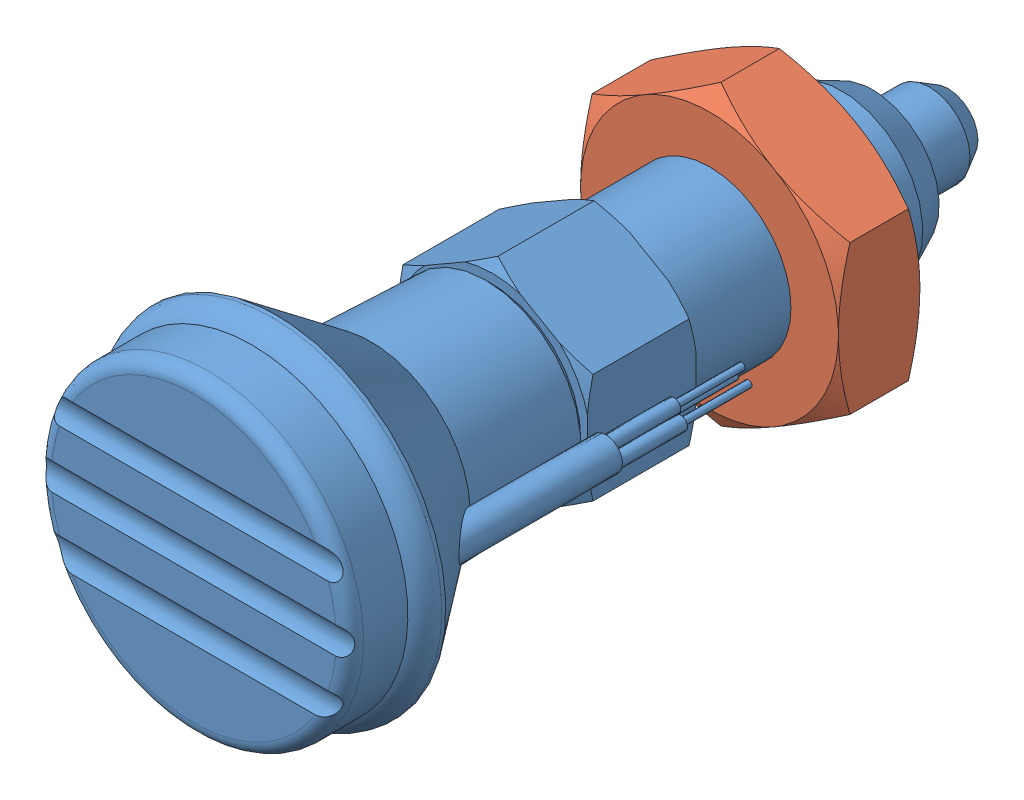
SolidWorks assembly NDX12W-S-SUS.sldasm, configuration Default (file format 15000). Lengths in mm.
Overall size (25.96 25.96 56.01).
2 component instances, 2 part files, 0 mates.
Components (placement in the parent):
- NDX12W-S-SUS_01-1: NDX12W-S-SUS_01.sldprt [ﾃﾞﾌｫﾙﾄ] at origin size (25 25 56.01)
- NDX12W-S-SUS_02-1: NDX12W-S-SUS_02.sldprt [ﾃﾞﾌｫﾙﾄ] at (0 0 -1) size (25.96 25.96 6.01)
